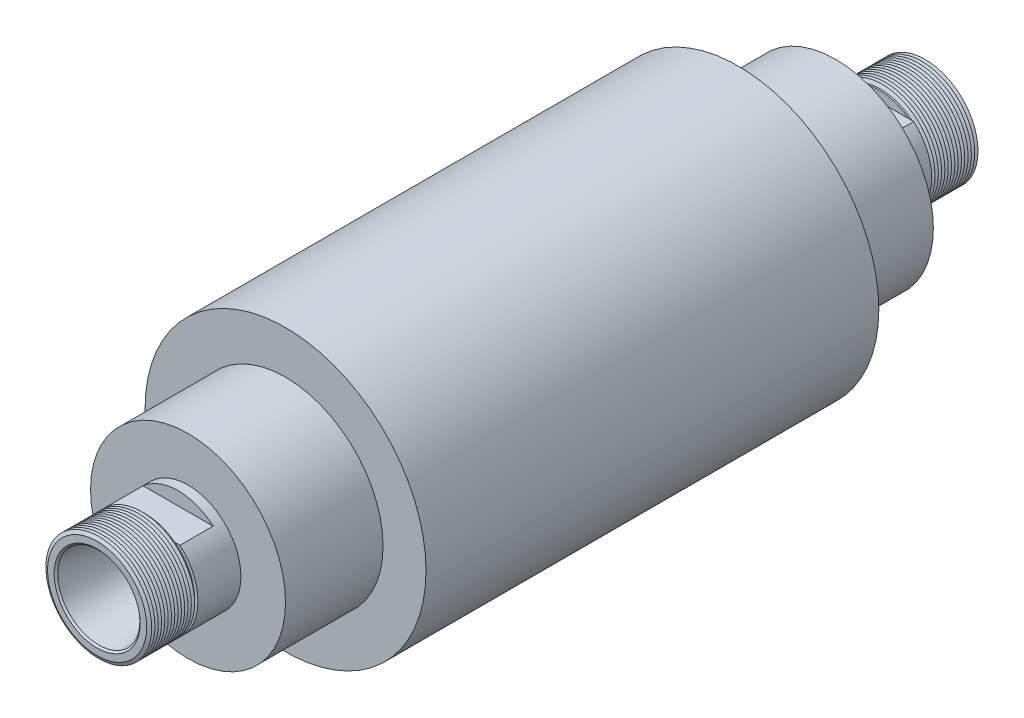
from build123d import *

# Parameters (mm, degrees)
CUT_EXTRUDE1_START = 12
SKETCH2_W          = 72.96432262
SKETCH2_H          = 10
CUT_EXTRUDE1_DEPTH = 10


with BuildPart() as part:
    # Sketch1 → Revolve1 (revolve)
    with BuildSketch(Plane(origin=(0, 0, 0), x_dir=(0, 0, -1), z_dir=(1, 0, 0)), mode=Mode.PRIVATE) as revolve1_sk:
        Polygon((0, 42.5), (-68.5, 42.5), (-68.5, 29.5), (-98, 29.5), (-98, 16), (-111, 16), (-111, 15), (-111.5, 15), (-112, 16), (-112.5, 15), (-113, 16), (-113.5, 15), (-114, 16), (-114.5, 15), (-115, 16), (-115.5, 15), (-116, 16), (-116.5, 15), (-117, 16), (-117.5, 15), (-118, 16), (-118.5, 15), (-119, 16), (-119.5, 15), (-120, 16), (-120.5, 15), (-121, 16), (-121.5, 15), (-122, 16), (-122.5, 15), (-123, 16), (-123.5, 15), (-124, 16), (-124.5, 15), (-125, 16), (-125.5, 15), (-125.5, 13), (-125.004865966, 12.43041345), (-95.5, 8.283774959), (-41.034482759, 8.283774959), (-41.034482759, 0), (0, 0), align=None)
    revolve1 = revolve(revolve1_sk.sketch.rotate(Axis((0, 0, 1375.982368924), (0, 0, -1)), 90), axis=Axis((0, 0, 1375.982368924), (0, 0, -1)))

    # Mirror1: Revolve1 across plane
    add(revolve1.mirror(Plane.XY))

    # Sketch2 → Cut-Extrude1 (cut)
    with BuildSketch(Plane(origin=(0, 0, 0), x_dir=(1, 0, 0), z_dir=(0, 1, 0)).offset(CUT_EXTRUDE1_START)):
        with Locations((0, 106)):
            Rectangle(SKETCH2_W, SKETCH2_H)
        with Locations((0, -106)):
            Rectangle(SKETCH2_W, SKETCH2_H)
    cut_extrude1 = extrude(amount=CUT_EXTRUDE1_DEPTH, mode=Mode.SUBTRACT)

    # Mirror2: Cut-Extrude1 across plane
    add(cut_extrude1.mirror(Plane.ZX), mode=Mode.SUBTRACT)


solid = part.part
